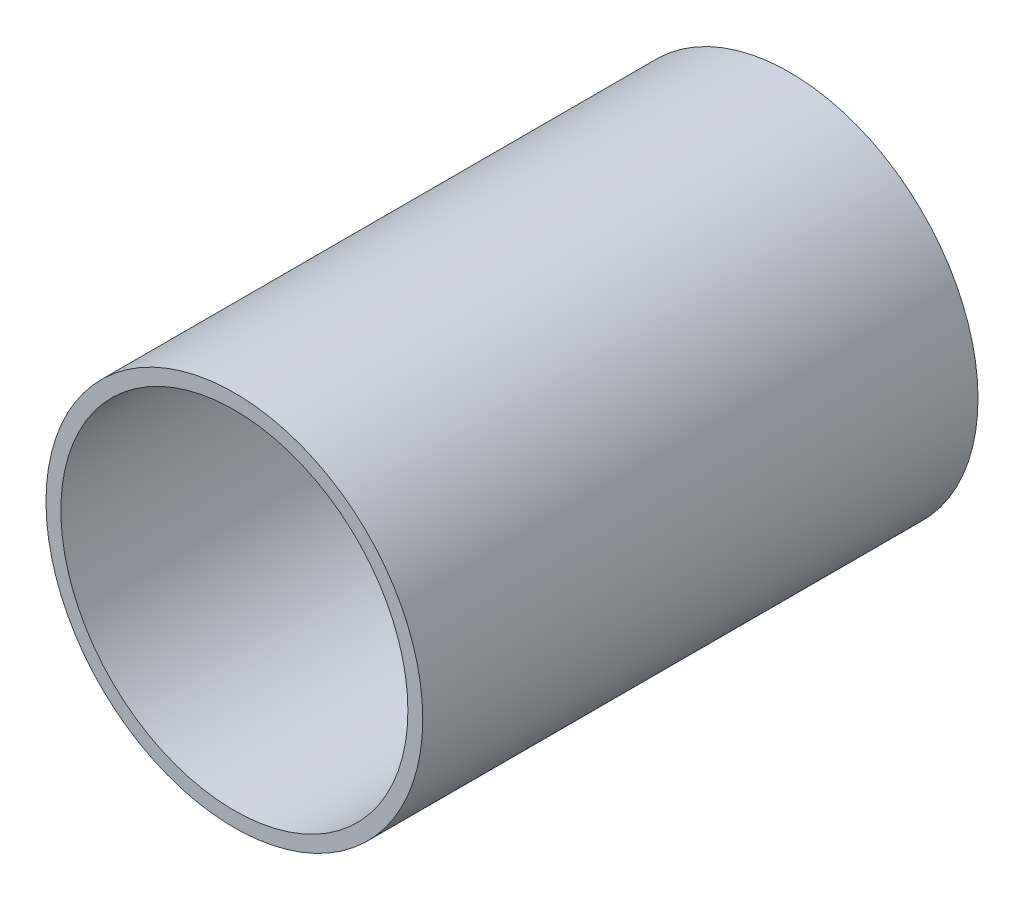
from build123d import *

# Parameters (mm, degrees)
SKETCH1_R           = 120.65
SKETCH1_R_2         = 111.125
BOSS_EXTRUDE1_DEPTH = 355.6


with BuildPart() as part:
    # Sketch1 → Boss-Extrude1 (new body)
    with BuildSketch(Plane.XY):
        Circle(SKETCH1_R)
        Circle(SKETCH1_R_2, mode=Mode.SUBTRACT)
    extrude(amount=-BOSS_EXTRUDE1_DEPTH)


solid = part.part
